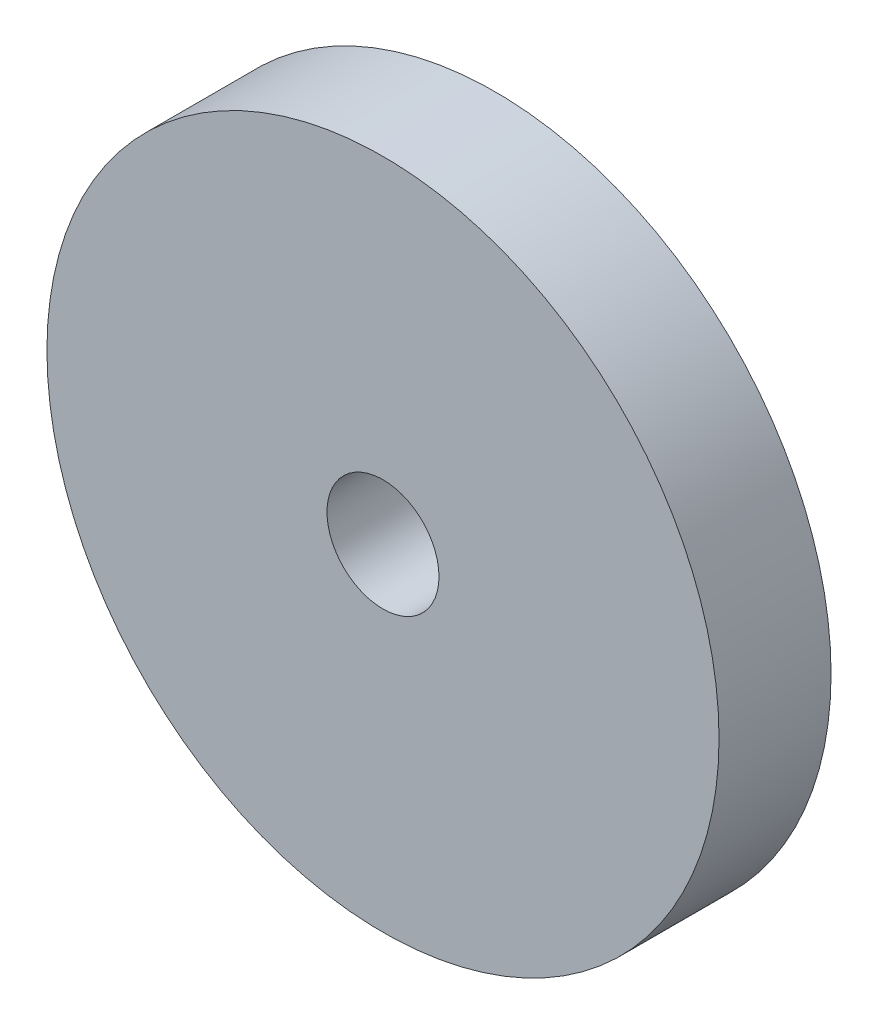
from build123d import *

# Parameters (mm, degrees)
SKETCH1_R           = 19.05
SKETCH1_R_2         = 3.175
BOSS_EXTRUDE1_DEPTH = 6.35


with BuildPart() as part:
    # Sketch1 → Boss-Extrude1 (new body)
    with BuildSketch(Plane.XY):
        Circle(SKETCH1_R)
        Circle(SKETCH1_R_2, mode=Mode.SUBTRACT)
    extrude(amount=BOSS_EXTRUDE1_DEPTH)


solid = part.part
